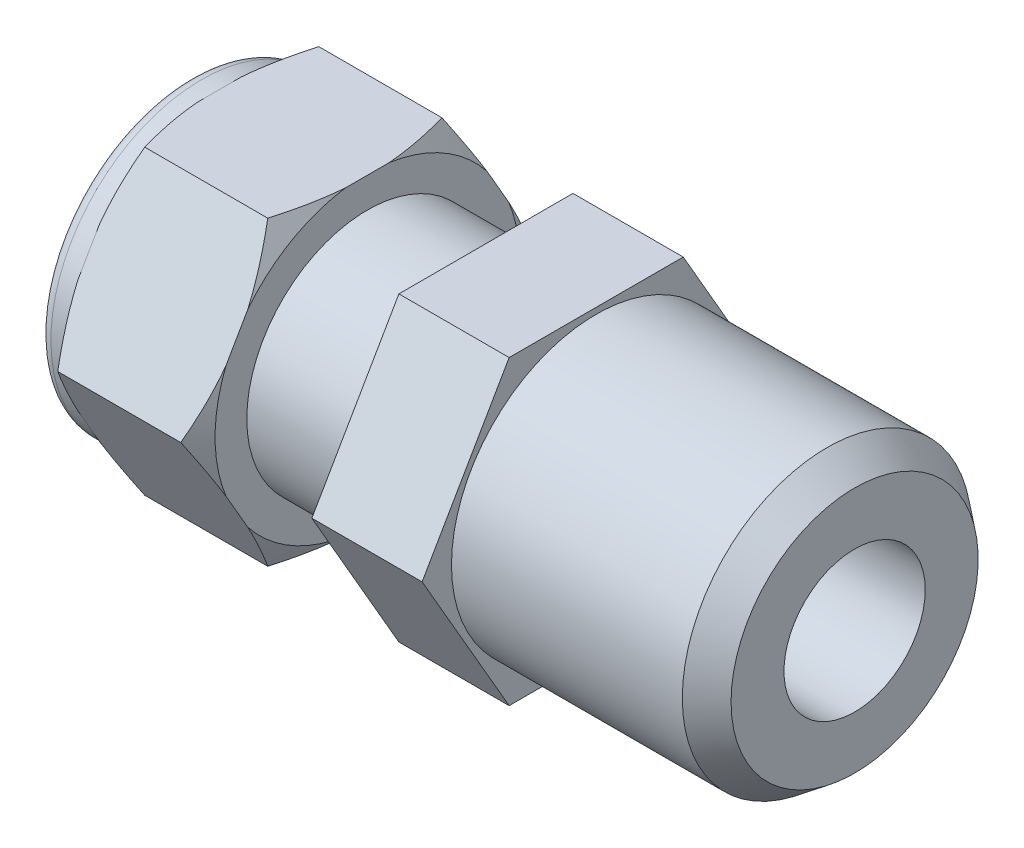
from build123d import *

# Parameters (mm, degrees)
HEX1_DEPTH         = 5.461
BODYFILLET_R       = 0.889
HEX2_DEPTH         = 8.128
DSCH_R             = 6.35
CUT_EXTRUDED_DEPTH = 22.86
SKETCH_E_R         = 5.207
CUT_EXTRUDEE_DEPTH = 26.162


with BuildPart() as part:
    # BodySch → Body (revolve)
    with BuildSketch(Plane.XY, mode=Mode.PRIVATE) as body_sk:
        Polygon((-49.022, 0), (-49.022, 11.1125), (-41.3766, 11.1125), (-41.3766, 8.89), (-27.178, 8.89), (-27.178, 10.668), (-2.033448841, 10.668), (0, 9.107679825), (0, 0), align=None)
    revolve(body_sk.sketch.rotate(Axis((-103.68469285, 0, 0), (1, 0, 0)), 90), axis=Axis((-103.68469285, 0, 0), (1, 0, 0)))

    # Hex1Sch_G → Hex1 (add, symmetric)
    with BuildSketch(Plane(origin=(-41.3766, 0, 0), x_dir=(0, 0, -1), z_dir=(1, 0, 0))):
        Polygon((12.831609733, 0), (6.415804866, 11.1125), (-6.415804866, 11.1125), (-12.831609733, 0), (-6.415804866, -11.1125), (6.415804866, -11.1125), align=None)
    extrude(amount=HEX1_DEPTH, both=True)

    # BodyFillet
    bodyfillet_edges = [part.edges().sort_by_distance(p)[0] for p in [
        (-49.022, 0, -11.1125),
    ]]
    fillet(bodyfillet_edges, radius=BODYFILLET_R)

    # HexfilletSch → Hexfillet (revolve, cut)
    with BuildSketch(Plane(origin=(0, 0, 0), x_dir=(1, 0, 0), z_dir=(0, 1, 0)), mode=Mode.PRIVATE) as hexfillet_sk:
        Polygon((-46.8376, 11.227658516), (-45.911558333, 12.831609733), (-46.8376, 12.831609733), align=None)
        Polygon((-35.9156, 11.227658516), (-36.841641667, 12.831609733), (-35.9156, 12.831609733), align=None)
    revolve(hexfillet_sk.sketch.rotate(Axis((-41.994761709, 0, 0), (1, 0, 0)), 150), axis=Axis((-41.994761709, 0, 0), (1, 0, 0)), mode=Mode.SUBTRACT)

    # Hex2Sch_F → Hex2 (add)
    with BuildSketch(Plane.ZY.offset(27.178)):
        Polygon((12.831609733, 0), (6.415804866, 11.1125), (-6.415804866, 11.1125), (-12.831609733, 0), (-6.415804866, -11.1125), (6.415804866, -11.1125), align=None)
    extrude(amount=-HEX2_DEPTH)

    # DSch → Cut-ExtrudeD (cut)
    with BuildSketch(Plane(origin=(-49.022, 0, 0), x_dir=(0, 0, -1), z_dir=(1, 0, 0))):
        Circle(DSCH_R)
    extrude(amount=CUT_EXTRUDED_DEPTH, mode=Mode.SUBTRACT)

    # Sketch E → Cut-ExtrudeE (cut)
    with BuildSketch(Plane(origin=(0, 0, 0), x_dir=(0, 0, -1), z_dir=(1, 0, 0))):
        Circle(SKETCH_E_R)
    extrude(amount=-CUT_EXTRUDEE_DEPTH, mode=Mode.SUBTRACT)


solid = part.part
